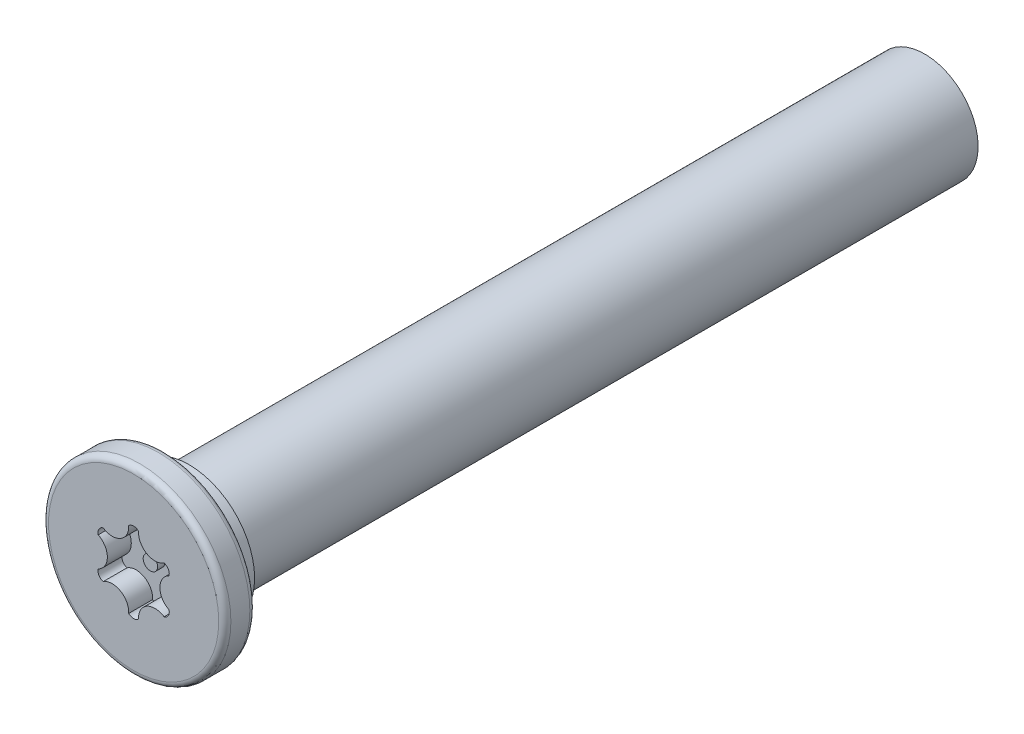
ISO-10303-21;
HEADER;
FILE_DESCRIPTION(('STEP AP214'),'2;1');
FILE_NAME('part.step','',(''),(''),'','','');
FILE_SCHEMA(('AUTOMOTIVE_DESIGN { 1 0 10303 214 1 1 1 1 }'));
ENDSEC;
DATA;
#1=APPLICATION_CONTEXT('core data for automotive mechanical design processes');
#2=APPLICATION_PROTOCOL_DEFINITION('international standard','automotive_design',2000,#1);
#3=PRODUCT_CONTEXT('',#1,'mechanical');
#4=PRODUCT('Part','Part','',(#3));
#5=PRODUCT_RELATED_PRODUCT_CATEGORY('part','',(#4));
#6=PRODUCT_DEFINITION_FORMATION('','',#4);
#7=PRODUCT_DEFINITION_CONTEXT('part definition',#1,'design');
#8=PRODUCT_DEFINITION('design','',#6,#7);
#9=PRODUCT_DEFINITION_SHAPE('','',#8);
#10=(LENGTH_UNIT() NAMED_UNIT(*) SI_UNIT(.MILLI.,.METRE.));
#11=(NAMED_UNIT(*) PLANE_ANGLE_UNIT() SI_UNIT($,.RADIAN.));
#12=(NAMED_UNIT(*) SI_UNIT($,.STERADIAN.) SOLID_ANGLE_UNIT());
#13=UNCERTAINTY_MEASURE_WITH_UNIT(LENGTH_MEASURE(1.E-05),#10,'distance_accuracy_value','');
#14=(GEOMETRIC_REPRESENTATION_CONTEXT(3) GLOBAL_UNCERTAINTY_ASSIGNED_CONTEXT((#13)) GLOBAL_UNIT_ASSIGNED_CONTEXT((#10,
#11,#12)) REPRESENTATION_CONTEXT('',''));
#15=CARTESIAN_POINT('',(0.,0.,0.));
#16=DIRECTION('',(0.,0.,1.));
#17=DIRECTION('',(1.,0.,0.));
#18=AXIS2_PLACEMENT_3D('',#15,#16,#17);
#19=CARTESIAN_POINT('',(0.,0.,0.));
#20=DIRECTION('',(0.,0.,1.));
#21=DIRECTION('',(1.,0.,0.));
#22=AXIS2_PLACEMENT_3D('',#19,#20,#21);
#23=PLANE('',#22);
#24=CARTESIAN_POINT('',(0.,0.,0.));
#25=DIRECTION('',(0.,0.,1.));
#26=DIRECTION('',(1.,0.,0.));
#27=AXIS2_PLACEMENT_3D('',#24,#25,#26);
#28=CIRCLE('',#27,3.55599999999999);
#29=CARTESIAN_POINT('',(3.55599999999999,0.,0.));
#30=VERTEX_POINT('',#29);
#31=EDGE_CURVE('E54',#30,#30,#28,.T.);
#32=ORIENTED_EDGE('',*,*,#31,.T.);
#33=EDGE_LOOP('',(#32));
#34=FACE_BOUND('',#33,.T.);
#35=CARTESIAN_POINT('',(0.893828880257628,1.54815703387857,0.));
#36=DIRECTION('',(0.,0.,1.));
#37=DIRECTION('',(1.,0.,0.));
#38=AXIS2_PLACEMENT_3D('',#35,#36,#37);
#39=CIRCLE('',#38,0.69);
#40=CARTESIAN_POINT('',(0.205060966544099,1.58937306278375,0.));
#41=VERTEX_POINT('',#40);
#42=CARTESIAN_POINT('',(1.27390696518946,0.972274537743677,0.));
#43=VERTEX_POINT('',#42);
#44=EDGE_CURVE('E181',#41,#43,#39,.T.);
#45=ORIENTED_EDGE('',*,*,#44,.T.);
#46=CARTESIAN_POINT('',(1.19884944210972,0.692156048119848,0.));
#47=DIRECTION('',(0.,0.,1.));
#48=DIRECTION('',(1.,0.,0.));
#49=AXIS2_PLACEMENT_3D('',#46,#47,#48);
#50=CIRCLE('',#49,0.29);
#51=CARTESIAN_POINT('',(1.47896793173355,0.617098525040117,0.));
#52=VERTEX_POINT('',#51);
#53=EDGE_CURVE('E61',#43,#52,#50,.F.);
#54=ORIENTED_EDGE('',*,*,#53,.T.);
#55=CARTESIAN_POINT('',(1.78765776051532,0.,0.));
#56=DIRECTION('',(0.,0.,1.));
#57=DIRECTION('',(1.,0.,0.));
#58=AXIS2_PLACEMENT_3D('',#55,#56,#57);
#59=CIRCLE('',#58,0.69);
#60=CARTESIAN_POINT('',(1.47896793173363,-0.617098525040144,0.));
#61=VERTEX_POINT('',#60);
#62=EDGE_CURVE('E111',#52,#61,#59,.T.);
#63=ORIENTED_EDGE('',*,*,#62,.T.);
#64=CARTESIAN_POINT('',(1.1988494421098,-0.692156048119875,0.));
#65=DIRECTION('',(0.,0.,1.));
#66=DIRECTION('',(1.,0.,0.));
#67=AXIS2_PLACEMENT_3D('',#64,#65,#66);
#68=CIRCLE('',#67,0.29);
#69=CARTESIAN_POINT('',(1.27390696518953,-0.972274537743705,0.));
#70=VERTEX_POINT('',#69);
#71=EDGE_CURVE('E216',#61,#70,#68,.F.);
#72=ORIENTED_EDGE('',*,*,#71,.T.);
#73=CARTESIAN_POINT('',(0.893828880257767,-1.54815703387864,0.));
#74=DIRECTION('',(0.,0.,1.));
#75=DIRECTION('',(1.,0.,0.));
#76=AXIS2_PLACEMENT_3D('',#73,#74,#75);
#77=CIRCLE('',#76,0.69);
#78=CARTESIAN_POINT('',(0.205060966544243,-1.5893730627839,0.));
#79=VERTEX_POINT('',#78);
#80=EDGE_CURVE('E160',#70,#79,#77,.T.);
#81=ORIENTED_EDGE('',*,*,#80,.T.);
#82=CARTESIAN_POINT('',(1.43067375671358E-13,-1.3843120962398,0.));
#83=DIRECTION('',(0.,0.,1.));
#84=DIRECTION('',(1.,0.,0.));
#85=AXIS2_PLACEMENT_3D('',#82,#83,#84);
#86=CIRCLE('',#85,0.29);
#87=CARTESIAN_POINT('',(-0.205060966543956,-1.5893730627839,0.));
#88=VERTEX_POINT('',#87);
#89=EDGE_CURVE('E210',#79,#88,#86,.F.);
#90=ORIENTED_EDGE('',*,*,#89,.T.);
#91=CARTESIAN_POINT('',(-0.893828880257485,-1.54815703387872,0.));
#92=DIRECTION('',(0.,0.,1.));
#93=DIRECTION('',(1.,0.,0.));
#94=AXIS2_PLACEMENT_3D('',#91,#92,#93);
#95=CIRCLE('',#94,0.69);
#96=CARTESIAN_POINT('',(-1.27390696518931,-0.97227453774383,0.));
#97=VERTEX_POINT('',#96);
#98=EDGE_CURVE('E206',#88,#97,#95,.T.);
#99=ORIENTED_EDGE('',*,*,#98,.T.);
#100=CARTESIAN_POINT('',(-1.19884944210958,-0.69215604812,0.));
#101=DIRECTION('',(0.,0.,1.));
#102=DIRECTION('',(1.,0.,0.));
#103=AXIS2_PLACEMENT_3D('',#100,#101,#102);
#104=CIRCLE('',#103,0.29);
#105=CARTESIAN_POINT('',(-1.47896793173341,-0.617098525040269,0.));
#106=VERTEX_POINT('',#105);
#107=EDGE_CURVE('E202',#97,#106,#104,.F.);
#108=ORIENTED_EDGE('',*,*,#107,.T.);
#109=CARTESIAN_POINT('',(-1.78765776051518,-1.56674837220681E-13,0.));
#110=DIRECTION('',(0.,0.,1.));
#111=DIRECTION('',(1.,0.,0.));
#112=AXIS2_PLACEMENT_3D('',#109,#110,#111);
#113=CIRCLE('',#112,0.69);
#114=CARTESIAN_POINT('',(-1.47896793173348,0.617098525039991,0.));
#115=VERTEX_POINT('',#114);
#116=EDGE_CURVE('E198',#106,#115,#113,.T.);
#117=ORIENTED_EDGE('',*,*,#116,.T.);
#118=CARTESIAN_POINT('',(-1.19884944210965,0.692156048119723,0.));
#119=DIRECTION('',(0.,0.,1.));
#120=DIRECTION('',(1.,0.,0.));
#121=AXIS2_PLACEMENT_3D('',#118,#119,#120);
#122=CIRCLE('',#121,0.29);
#123=CARTESIAN_POINT('',(-1.27390696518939,0.972274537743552,0.));
#124=VERTEX_POINT('',#123);
#125=EDGE_CURVE('E194',#115,#124,#122,.F.);
#126=ORIENTED_EDGE('',*,*,#125,.T.);
#127=CARTESIAN_POINT('',(-0.893828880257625,1.54815703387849,0.));
#128=DIRECTION('',(0.,0.,1.));
#129=DIRECTION('',(1.,0.,0.));
#130=AXIS2_PLACEMENT_3D('',#127,#128,#129);
#131=CIRCLE('',#130,0.690000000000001);
#132=CARTESIAN_POINT('',(-0.205060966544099,1.58937306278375,0.));
#133=VERTEX_POINT('',#132);
#134=EDGE_CURVE('E190',#124,#133,#131,.T.);
#135=ORIENTED_EDGE('',*,*,#134,.T.);
#136=CARTESIAN_POINT('',(0.,1.38431209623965,0.));
#137=DIRECTION('',(0.,0.,1.));
#138=DIRECTION('',(1.,0.,0.));
#139=AXIS2_PLACEMENT_3D('',#136,#137,#138);
#140=CIRCLE('',#139,0.29);
#141=EDGE_CURVE('E186',#133,#41,#140,.F.);
#142=ORIENTED_EDGE('',*,*,#141,.T.);
#143=EDGE_LOOP('',(#45,#54,#63,#72,#81,#90,#99,#108,#117,#126,#135,#142));
#144=FACE_BOUND('',#143,.T.);
#145=ADVANCED_FACE('F45',(#34,#144),#23,.T.);
#146=CARTESIAN_POINT('',(0.,0.,-1.3));
#147=DIRECTION('',(0.,0.,1.));
#148=DIRECTION('',(1.,0.,0.));
#149=AXIS2_PLACEMENT_3D('',#146,#147,#148);
#150=PLANE('',#149);
#151=CARTESIAN_POINT('',(0.,0.,-1.3));
#152=DIRECTION('',(0.,0.,1.));
#153=DIRECTION('',(1.,0.,0.));
#154=AXIS2_PLACEMENT_3D('',#151,#152,#153);
#155=CIRCLE('',#154,2.738000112);
#156=CARTESIAN_POINT('',(2.738000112,0.,-1.3));
#157=VERTEX_POINT('',#156);
#158=EDGE_CURVE('E11',#157,#157,#155,.F.);
#159=ORIENTED_EDGE('',*,*,#158,.F.);
#160=EDGE_LOOP('',(#159));
#161=FACE_BOUND('',#160,.T.);
#162=CARTESIAN_POINT('',(0.,0.,-1.3));
#163=DIRECTION('',(0.,0.,1.));
#164=DIRECTION('',(1.,0.,0.));
#165=AXIS2_PLACEMENT_3D('',#162,#163,#164);
#166=CIRCLE('',#165,3.55599999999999);
#167=CARTESIAN_POINT('',(3.55599999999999,0.,-1.3));
#168=VERTEX_POINT('',#167);
#169=EDGE_CURVE('E260',#168,#168,#166,.F.);
#170=ORIENTED_EDGE('',*,*,#169,.T.);
#171=EDGE_LOOP('',(#170));
#172=FACE_BOUND('',#171,.T.);
#173=ADVANCED_FACE('F283',(#161,#172),#150,.F.);
#174=CARTESIAN_POINT('',(0.,0.,-1.3));
#175=DIRECTION('',(0.,0.,1.));
#176=DIRECTION('',(1.,0.,0.));
#177=AXIS2_PLACEMENT_3D('',#174,#175,#176);
#178=CYLINDRICAL_SURFACE('',#177,3.80999999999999);
#179=CARTESIAN_POINT('',(0.,0.,-1.046));
#180=DIRECTION('',(0.,0.,1.));
#181=DIRECTION('',(1.,0.,0.));
#182=AXIS2_PLACEMENT_3D('',#179,#180,#181);
#183=CIRCLE('',#182,3.80999999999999);
#184=CARTESIAN_POINT('',(3.80999999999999,0.,-1.046));
#185=VERTEX_POINT('',#184);
#186=EDGE_CURVE('E256',#185,#185,#183,.T.);
#187=ORIENTED_EDGE('',*,*,#186,.T.);
#188=EDGE_LOOP('',(#187));
#189=FACE_BOUND('',#188,.T.);
#190=CARTESIAN_POINT('',(0.,0.,-0.254));
#191=DIRECTION('',(0.,0.,1.));
#192=DIRECTION('',(1.,0.,0.));
#193=AXIS2_PLACEMENT_3D('',#190,#191,#192);
#194=CIRCLE('',#193,3.80999999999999);
#195=CARTESIAN_POINT('',(3.80999999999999,0.,-0.254));
#196=VERTEX_POINT('',#195);
#197=EDGE_CURVE('E225',#196,#196,#194,.F.);
#198=ORIENTED_EDGE('',*,*,#197,.T.);
#199=EDGE_LOOP('',(#198));
#200=FACE_BOUND('',#199,.T.);
#201=ADVANCED_FACE('F289',(#189,#200),#178,.T.);
#202=CARTESIAN_POINT('',(1.19884944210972,0.692156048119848,-1.));
#203=DIRECTION('',(0.,0.,1.));
#204=DIRECTION('',(1.,0.,0.));
#205=AXIS2_PLACEMENT_3D('',#202,#203,#204);
#206=CYLINDRICAL_SURFACE('',#205,0.29);
#207=ORIENTED_EDGE('',*,*,#53,.F.);
#208=DIRECTION('',(0.,0.,1.));
#209=VECTOR('',#208,1.);
#210=CARTESIAN_POINT('',(1.27390696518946,0.972274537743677,-1.));
#211=LINE('',#210,#209);
#212=CARTESIAN_POINT('',(1.27390696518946,0.972274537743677,-1.));
#213=VERTEX_POINT('',#212);
#214=EDGE_CURVE('E178',#213,#43,#211,.T.);
#215=ORIENTED_EDGE('',*,*,#214,.F.);
#216=CARTESIAN_POINT('',(1.19884944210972,0.692156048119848,-1.));
#217=DIRECTION('',(0.,0.,1.));
#218=DIRECTION('',(1.,0.,0.));
#219=AXIS2_PLACEMENT_3D('',#216,#217,#218);
#220=CIRCLE('',#219,0.29);
#221=CARTESIAN_POINT('',(1.47896793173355,0.617098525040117,-1.));
#222=VERTEX_POINT('',#221);
#223=EDGE_CURVE('E221',#213,#222,#220,.F.);
#224=ORIENTED_EDGE('',*,*,#223,.T.);
#225=DIRECTION('',(0.,0.,1.));
#226=VECTOR('',#225,1.);
#227=CARTESIAN_POINT('',(1.47896793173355,0.617098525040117,-1.));
#228=LINE('',#227,#226);
#229=EDGE_CURVE('E222',#222,#52,#228,.T.);
#230=ORIENTED_EDGE('',*,*,#229,.T.);
#231=EDGE_LOOP('',(#207,#215,#224,#230));
#232=FACE_BOUND('',#231,.T.);
#233=ADVANCED_FACE('F294',(#232),#206,.F.);
#234=CARTESIAN_POINT('',(1.78765776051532,0.,-1.));
#235=DIRECTION('',(0.,0.,1.));
#236=DIRECTION('',(1.,0.,0.));
#237=AXIS2_PLACEMENT_3D('',#234,#235,#236);
#238=CYLINDRICAL_SURFACE('',#237,0.69);
#239=ORIENTED_EDGE('',*,*,#62,.F.);
#240=ORIENTED_EDGE('',*,*,#229,.F.);
#241=CARTESIAN_POINT('',(1.78765776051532,0.,-1.));
#242=DIRECTION('',(0.,0.,1.));
#243=DIRECTION('',(1.,0.,0.));
#244=AXIS2_PLACEMENT_3D('',#241,#242,#243);
#245=CIRCLE('',#244,0.69);
#246=CARTESIAN_POINT('',(1.47896793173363,-0.617098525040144,-1.));
#247=VERTEX_POINT('',#246);
#248=EDGE_CURVE('E70',#222,#247,#245,.T.);
#249=ORIENTED_EDGE('',*,*,#248,.T.);
#250=DIRECTION('',(0.,0.,1.));
#251=VECTOR('',#250,1.);
#252=CARTESIAN_POINT('',(1.47896793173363,-0.617098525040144,-1.));
#253=LINE('',#252,#251);
#254=EDGE_CURVE('E151',#247,#61,#253,.T.);
#255=ORIENTED_EDGE('',*,*,#254,.T.);
#256=EDGE_LOOP('',(#239,#240,#249,#255));
#257=FACE_BOUND('',#256,.T.);
#258=ADVANCED_FACE('F301',(#257),#238,.T.);
#259=CARTESIAN_POINT('',(1.1988494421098,-0.692156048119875,-1.));
#260=DIRECTION('',(0.,0.,1.));
#261=DIRECTION('',(1.,0.,0.));
#262=AXIS2_PLACEMENT_3D('',#259,#260,#261);
#263=CYLINDRICAL_SURFACE('',#262,0.29);
#264=ORIENTED_EDGE('',*,*,#71,.F.);
#265=ORIENTED_EDGE('',*,*,#254,.F.);
#266=CARTESIAN_POINT('',(1.1988494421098,-0.692156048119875,-1.));
#267=DIRECTION('',(0.,0.,1.));
#268=DIRECTION('',(1.,0.,0.));
#269=AXIS2_PLACEMENT_3D('',#266,#267,#268);
#270=CIRCLE('',#269,0.29);
#271=CARTESIAN_POINT('',(1.27390696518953,-0.972274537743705,-1.));
#272=VERTEX_POINT('',#271);
#273=EDGE_CURVE('E145',#247,#272,#270,.F.);
#274=ORIENTED_EDGE('',*,*,#273,.T.);
#275=DIRECTION('',(0.,0.,1.));
#276=VECTOR('',#275,1.);
#277=CARTESIAN_POINT('',(1.27390696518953,-0.972274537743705,-1.));
#278=LINE('',#277,#276);
#279=EDGE_CURVE('E149',#272,#70,#278,.T.);
#280=ORIENTED_EDGE('',*,*,#279,.T.);
#281=EDGE_LOOP('',(#264,#265,#274,#280));
#282=FACE_BOUND('',#281,.T.);
#283=ADVANCED_FACE('F148',(#282),#263,.F.);
#284=CARTESIAN_POINT('',(0.893828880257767,-1.54815703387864,-1.));
#285=DIRECTION('',(0.,0.,1.));
#286=DIRECTION('',(1.,0.,0.));
#287=AXIS2_PLACEMENT_3D('',#284,#285,#286);
#288=CYLINDRICAL_SURFACE('',#287,0.69);
#289=ORIENTED_EDGE('',*,*,#80,.F.);
#290=ORIENTED_EDGE('',*,*,#279,.F.);
#291=CARTESIAN_POINT('',(0.893828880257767,-1.54815703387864,-1.));
#292=DIRECTION('',(0.,0.,1.));
#293=DIRECTION('',(1.,0.,0.));
#294=AXIS2_PLACEMENT_3D('',#291,#292,#293);
#295=CIRCLE('',#294,0.69);
#296=CARTESIAN_POINT('',(0.205060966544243,-1.5893730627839,-1.));
#297=VERTEX_POINT('',#296);
#298=EDGE_CURVE('E154',#272,#297,#295,.T.);
#299=ORIENTED_EDGE('',*,*,#298,.T.);
#300=DIRECTION('',(0.,0.,1.));
#301=VECTOR('',#300,1.);
#302=CARTESIAN_POINT('',(0.205060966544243,-1.5893730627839,-1.));
#303=LINE('',#302,#301);
#304=EDGE_CURVE('E163',#297,#79,#303,.T.);
#305=ORIENTED_EDGE('',*,*,#304,.T.);
#306=EDGE_LOOP('',(#289,#290,#299,#305));
#307=FACE_BOUND('',#306,.T.);
#308=ADVANCED_FACE('F157',(#307),#288,.T.);
#309=CARTESIAN_POINT('',(1.43067375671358E-13,-1.3843120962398,-1.));
#310=DIRECTION('',(0.,0.,1.));
#311=DIRECTION('',(1.,0.,0.));
#312=AXIS2_PLACEMENT_3D('',#309,#310,#311);
#313=CYLINDRICAL_SURFACE('',#312,0.29);
#314=ORIENTED_EDGE('',*,*,#89,.F.);
#315=ORIENTED_EDGE('',*,*,#304,.F.);
#316=CARTESIAN_POINT('',(1.43067375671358E-13,-1.3843120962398,-1.));
#317=DIRECTION('',(0.,0.,1.));
#318=DIRECTION('',(1.,0.,0.));
#319=AXIS2_PLACEMENT_3D('',#316,#317,#318);
#320=CIRCLE('',#319,0.29);
#321=CARTESIAN_POINT('',(-0.205060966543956,-1.5893730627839,-1.));
#322=VERTEX_POINT('',#321);
#323=EDGE_CURVE('E168',#297,#322,#320,.F.);
#324=ORIENTED_EDGE('',*,*,#323,.T.);
#325=DIRECTION('',(0.,0.,1.));
#326=VECTOR('',#325,1.);
#327=CARTESIAN_POINT('',(-0.205060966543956,-1.5893730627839,-1.));
#328=LINE('',#327,#326);
#329=EDGE_CURVE('E230',#322,#88,#328,.T.);
#330=ORIENTED_EDGE('',*,*,#329,.T.);
#331=EDGE_LOOP('',(#314,#315,#324,#330));
#332=FACE_BOUND('',#331,.T.);
#333=ADVANCED_FACE('F318',(#332),#313,.F.);
#334=CARTESIAN_POINT('',(-0.893828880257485,-1.54815703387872,-1.));
#335=DIRECTION('',(0.,0.,1.));
#336=DIRECTION('',(1.,0.,0.));
#337=AXIS2_PLACEMENT_3D('',#334,#335,#336);
#338=CYLINDRICAL_SURFACE('',#337,0.69);
#339=ORIENTED_EDGE('',*,*,#98,.F.);
#340=ORIENTED_EDGE('',*,*,#329,.F.);
#341=CARTESIAN_POINT('',(-0.893828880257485,-1.54815703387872,-1.));
#342=DIRECTION('',(0.,0.,1.));
#343=DIRECTION('',(1.,0.,0.));
#344=AXIS2_PLACEMENT_3D('',#341,#342,#343);
#345=CIRCLE('',#344,0.69);
#346=CARTESIAN_POINT('',(-1.27390696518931,-0.97227453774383,-1.));
#347=VERTEX_POINT('',#346);
#348=EDGE_CURVE('E172',#322,#347,#345,.T.);
#349=ORIENTED_EDGE('',*,*,#348,.T.);
#350=DIRECTION('',(0.,0.,1.));
#351=VECTOR('',#350,1.);
#352=CARTESIAN_POINT('',(-1.27390696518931,-0.97227453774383,-1.));
#353=LINE('',#352,#351);
#354=EDGE_CURVE('E233',#347,#97,#353,.T.);
#355=ORIENTED_EDGE('',*,*,#354,.T.);
#356=EDGE_LOOP('',(#339,#340,#349,#355));
#357=FACE_BOUND('',#356,.T.);
#358=ADVANCED_FACE('F321',(#357),#338,.T.);
#359=CARTESIAN_POINT('',(-1.19884944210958,-0.69215604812,-1.));
#360=DIRECTION('',(0.,0.,1.));
#361=DIRECTION('',(1.,0.,0.));
#362=AXIS2_PLACEMENT_3D('',#359,#360,#361);
#363=CYLINDRICAL_SURFACE('',#362,0.29);
#364=ORIENTED_EDGE('',*,*,#107,.F.);
#365=ORIENTED_EDGE('',*,*,#354,.F.);
#366=CARTESIAN_POINT('',(-1.19884944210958,-0.69215604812,-1.));
#367=DIRECTION('',(0.,0.,1.));
#368=DIRECTION('',(1.,0.,0.));
#369=AXIS2_PLACEMENT_3D('',#366,#367,#368);
#370=CIRCLE('',#369,0.29);
#371=CARTESIAN_POINT('',(-1.47896793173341,-0.617098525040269,-1.));
#372=VERTEX_POINT('',#371);
#373=EDGE_CURVE('E374',#347,#372,#370,.F.);
#374=ORIENTED_EDGE('',*,*,#373,.T.);
#375=DIRECTION('',(0.,0.,1.));
#376=VECTOR('',#375,1.);
#377=CARTESIAN_POINT('',(-1.47896793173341,-0.617098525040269,-1.));
#378=LINE('',#377,#376);
#379=EDGE_CURVE('E236',#372,#106,#378,.T.);
#380=ORIENTED_EDGE('',*,*,#379,.T.);
#381=EDGE_LOOP('',(#364,#365,#374,#380));
#382=FACE_BOUND('',#381,.T.);
#383=ADVANCED_FACE('F325',(#382),#363,.F.);
#384=CARTESIAN_POINT('',(-1.78765776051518,-1.56674837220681E-13,-1.));
#385=DIRECTION('',(0.,0.,1.));
#386=DIRECTION('',(1.,0.,0.));
#387=AXIS2_PLACEMENT_3D('',#384,#385,#386);
#388=CYLINDRICAL_SURFACE('',#387,0.69);
#389=ORIENTED_EDGE('',*,*,#116,.F.);
#390=ORIENTED_EDGE('',*,*,#379,.F.);
#391=CARTESIAN_POINT('',(-1.78765776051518,-1.56674837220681E-13,-1.));
#392=DIRECTION('',(0.,0.,1.));
#393=DIRECTION('',(1.,0.,0.));
#394=AXIS2_PLACEMENT_3D('',#391,#392,#393);
#395=CIRCLE('',#394,0.69);
#396=CARTESIAN_POINT('',(-1.47896793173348,0.617098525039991,-1.));
#397=VERTEX_POINT('',#396);
#398=EDGE_CURVE('E371',#372,#397,#395,.T.);
#399=ORIENTED_EDGE('',*,*,#398,.T.);
#400=DIRECTION('',(0.,0.,1.));
#401=VECTOR('',#400,1.);
#402=CARTESIAN_POINT('',(-1.47896793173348,0.617098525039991,-1.));
#403=LINE('',#402,#401);
#404=EDGE_CURVE('E239',#397,#115,#403,.T.);
#405=ORIENTED_EDGE('',*,*,#404,.T.);
#406=EDGE_LOOP('',(#389,#390,#399,#405));
#407=FACE_BOUND('',#406,.T.);
#408=ADVANCED_FACE('F329',(#407),#388,.T.);
#409=CARTESIAN_POINT('',(-1.19884944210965,0.692156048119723,-1.));
#410=DIRECTION('',(0.,0.,1.));
#411=DIRECTION('',(1.,0.,0.));
#412=AXIS2_PLACEMENT_3D('',#409,#410,#411);
#413=CYLINDRICAL_SURFACE('',#412,0.29);
#414=ORIENTED_EDGE('',*,*,#125,.F.);
#415=ORIENTED_EDGE('',*,*,#404,.F.);
#416=CARTESIAN_POINT('',(-1.19884944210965,0.692156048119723,-1.));
#417=DIRECTION('',(0.,0.,1.));
#418=DIRECTION('',(1.,0.,0.));
#419=AXIS2_PLACEMENT_3D('',#416,#417,#418);
#420=CIRCLE('',#419,0.29);
#421=CARTESIAN_POINT('',(-1.27390696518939,0.972274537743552,-1.));
#422=VERTEX_POINT('',#421);
#423=EDGE_CURVE('E364',#397,#422,#420,.F.);
#424=ORIENTED_EDGE('',*,*,#423,.T.);
#425=DIRECTION('',(0.,0.,1.));
#426=VECTOR('',#425,1.);
#427=CARTESIAN_POINT('',(-1.27390696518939,0.972274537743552,-1.));
#428=LINE('',#427,#426);
#429=EDGE_CURVE('E242',#422,#124,#428,.T.);
#430=ORIENTED_EDGE('',*,*,#429,.T.);
#431=EDGE_LOOP('',(#414,#415,#424,#430));
#432=FACE_BOUND('',#431,.T.);
#433=ADVANCED_FACE('F333',(#432),#413,.F.);
#434=CARTESIAN_POINT('',(-0.893828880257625,1.54815703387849,-1.));
#435=DIRECTION('',(0.,0.,1.));
#436=DIRECTION('',(1.,0.,0.));
#437=AXIS2_PLACEMENT_3D('',#434,#435,#436);
#438=CYLINDRICAL_SURFACE('',#437,0.690000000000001);
#439=ORIENTED_EDGE('',*,*,#134,.F.);
#440=ORIENTED_EDGE('',*,*,#429,.F.);
#441=CARTESIAN_POINT('',(-0.893828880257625,1.54815703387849,-1.));
#442=DIRECTION('',(0.,0.,1.));
#443=DIRECTION('',(1.,0.,0.));
#444=AXIS2_PLACEMENT_3D('',#441,#442,#443);
#445=CIRCLE('',#444,0.690000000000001);
#446=CARTESIAN_POINT('',(-0.205060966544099,1.58937306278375,-1.));
#447=VERTEX_POINT('',#446);
#448=EDGE_CURVE('E360',#422,#447,#445,.T.);
#449=ORIENTED_EDGE('',*,*,#448,.T.);
#450=DIRECTION('',(0.,0.,1.));
#451=VECTOR('',#450,1.);
#452=CARTESIAN_POINT('',(-0.205060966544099,1.58937306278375,-1.));
#453=LINE('',#452,#451);
#454=EDGE_CURVE('E245',#447,#133,#453,.T.);
#455=ORIENTED_EDGE('',*,*,#454,.T.);
#456=EDGE_LOOP('',(#439,#440,#449,#455));
#457=FACE_BOUND('',#456,.T.);
#458=ADVANCED_FACE('F337',(#457),#438,.T.);
#459=CARTESIAN_POINT('',(0.,1.38431209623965,-1.));
#460=DIRECTION('',(0.,0.,1.));
#461=DIRECTION('',(1.,0.,0.));
#462=AXIS2_PLACEMENT_3D('',#459,#460,#461);
#463=CYLINDRICAL_SURFACE('',#462,0.29);
#464=ORIENTED_EDGE('',*,*,#141,.F.);
#465=ORIENTED_EDGE('',*,*,#454,.F.);
#466=CARTESIAN_POINT('',(0.,1.38431209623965,-1.));
#467=DIRECTION('',(0.,0.,1.));
#468=DIRECTION('',(1.,0.,0.));
#469=AXIS2_PLACEMENT_3D('',#466,#467,#468);
#470=CIRCLE('',#469,0.29);
#471=CARTESIAN_POINT('',(0.205060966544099,1.58937306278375,-1.));
#472=VERTEX_POINT('',#471);
#473=EDGE_CURVE('E357',#447,#472,#470,.F.);
#474=ORIENTED_EDGE('',*,*,#473,.T.);
#475=DIRECTION('',(0.,0.,1.));
#476=VECTOR('',#475,1.);
#477=CARTESIAN_POINT('',(0.205060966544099,1.58937306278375,-1.));
#478=LINE('',#477,#476);
#479=EDGE_CURVE('E248',#472,#41,#478,.T.);
#480=ORIENTED_EDGE('',*,*,#479,.T.);
#481=EDGE_LOOP('',(#464,#465,#474,#480));
#482=FACE_BOUND('',#481,.T.);
#483=ADVANCED_FACE('F341',(#482),#463,.F.);
#484=CARTESIAN_POINT('',(0.893828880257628,1.54815703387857,-1.));
#485=DIRECTION('',(0.,0.,1.));
#486=DIRECTION('',(1.,0.,0.));
#487=AXIS2_PLACEMENT_3D('',#484,#485,#486);
#488=CYLINDRICAL_SURFACE('',#487,0.69);
#489=ORIENTED_EDGE('',*,*,#44,.F.);
#490=ORIENTED_EDGE('',*,*,#479,.F.);
#491=CARTESIAN_POINT('',(0.893828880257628,1.54815703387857,-1.));
#492=DIRECTION('',(0.,0.,1.));
#493=DIRECTION('',(1.,0.,0.));
#494=AXIS2_PLACEMENT_3D('',#491,#492,#493);
#495=CIRCLE('',#494,0.69);
#496=EDGE_CURVE('E118',#472,#213,#495,.T.);
#497=ORIENTED_EDGE('',*,*,#496,.T.);
#498=ORIENTED_EDGE('',*,*,#214,.T.);
#499=EDGE_LOOP('',(#489,#490,#497,#498));
#500=FACE_BOUND('',#499,.T.);
#501=ADVANCED_FACE('F344',(#500),#488,.T.);
#502=CARTESIAN_POINT('',(0.,0.,-1.));
#503=DIRECTION('',(0.,0.,1.));
#504=DIRECTION('',(1.,0.,0.));
#505=AXIS2_PLACEMENT_3D('',#502,#503,#504);
#506=PLANE('',#505);
#507=CARTESIAN_POINT('',(0.,0.,-1.));
#508=DIRECTION('',(0.,0.,1.));
#509=DIRECTION('',(1.,0.,0.));
#510=AXIS2_PLACEMENT_3D('',#507,#508,#509);
#511=CIRCLE('',#510,0.3);
#512=CARTESIAN_POINT('',(0.3,0.,-1.));
#513=VERTEX_POINT('',#512);
#514=EDGE_CURVE('E396',#513,#513,#511,.T.);
#515=ORIENTED_EDGE('',*,*,#514,.F.);
#516=EDGE_LOOP('',(#515));
#517=FACE_BOUND('',#516,.T.);
#518=ORIENTED_EDGE('',*,*,#223,.F.);
#519=ORIENTED_EDGE('',*,*,#496,.F.);
#520=ORIENTED_EDGE('',*,*,#473,.F.);
#521=ORIENTED_EDGE('',*,*,#448,.F.);
#522=ORIENTED_EDGE('',*,*,#423,.F.);
#523=ORIENTED_EDGE('',*,*,#398,.F.);
#524=ORIENTED_EDGE('',*,*,#373,.F.);
#525=ORIENTED_EDGE('',*,*,#348,.F.);
#526=ORIENTED_EDGE('',*,*,#323,.F.);
#527=ORIENTED_EDGE('',*,*,#298,.F.);
#528=ORIENTED_EDGE('',*,*,#273,.F.);
#529=ORIENTED_EDGE('',*,*,#248,.F.);
#530=EDGE_LOOP('',(#518,#519,#520,#521,#522,#523,#524,#525,#526,#527,#528,#529));
#531=FACE_BOUND('',#530,.T.);
#532=ADVANCED_FACE('F166',(#517,#531),#506,.T.);
#533=CARTESIAN_POINT('',(0.,0.,-1.046));
#534=DIRECTION('',(0.,0.,1.));
#535=DIRECTION('',(1.,0.,0.));
#536=AXIS2_PLACEMENT_3D('',#533,#534,#535);
#537=TOROIDAL_SURFACE('',#536,3.55599999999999,0.254);
#538=ORIENTED_EDGE('',*,*,#169,.F.);
#539=EDGE_LOOP('',(#538));
#540=FACE_BOUND('',#539,.T.);
#541=ORIENTED_EDGE('',*,*,#186,.F.);
#542=EDGE_LOOP('',(#541));
#543=FACE_BOUND('',#542,.T.);
#544=ADVANCED_FACE('F271',(#540,#543),#537,.T.);
#545=CARTESIAN_POINT('',(0.,0.,-0.254));
#546=DIRECTION('',(0.,0.,1.));
#547=DIRECTION('',(1.,0.,0.));
#548=AXIS2_PLACEMENT_3D('',#545,#546,#547);
#549=TOROIDAL_SURFACE('',#548,3.55599999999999,0.254);
#550=ORIENTED_EDGE('',*,*,#197,.F.);
#551=EDGE_LOOP('',(#550));
#552=FACE_BOUND('',#551,.T.);
#553=ORIENTED_EDGE('',*,*,#31,.F.);
#554=EDGE_LOOP('',(#553));
#555=FACE_BOUND('',#554,.T.);
#556=ADVANCED_FACE('F47',(#552,#555),#549,.T.);
#557=CARTESIAN_POINT('',(0.,0.,-2.316));
#558=DIRECTION('',(0.,0.,-1.));
#559=DIRECTION('',(-1.,0.,0.));
#560=AXIS2_PLACEMENT_3D('',#557,#558,#559);
#561=PLANE('',#560);
#562=CARTESIAN_POINT('',(0.,0.,-2.316));
#563=DIRECTION('',(0.,0.,-1.));
#564=DIRECTION('',(-1.,0.,0.));
#565=AXIS2_PLACEMENT_3D('',#562,#563,#564);
#566=CIRCLE('',#565,2.738000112);
#567=CARTESIAN_POINT('',(-2.738000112,0.,-2.316));
#568=VERTEX_POINT('',#567);
#569=EDGE_CURVE('E182',#568,#568,#566,.T.);
#570=ORIENTED_EDGE('',*,*,#569,.T.);
#571=EDGE_LOOP('',(#570));
#572=FACE_BOUND('',#571,.T.);
#573=CARTESIAN_POINT('',(0.,0.,-2.316));
#574=DIRECTION('',(0.,0.,-1.));
#575=DIRECTION('',(-1.,0.,0.));
#576=AXIS2_PLACEMENT_3D('',#573,#574,#575);
#577=CIRCLE('',#576,2.230000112);
#578=CARTESIAN_POINT('',(-2.230000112,0.,-2.316));
#579=VERTEX_POINT('',#578);
#580=EDGE_CURVE('E400',#579,#579,#577,.T.);
#581=ORIENTED_EDGE('',*,*,#580,.F.);
#582=EDGE_LOOP('',(#581));
#583=FACE_BOUND('',#582,.T.);
#584=ADVANCED_FACE('F270',(#572,#583),#561,.T.);
#585=CARTESIAN_POINT('',(0.,0.,-2.316));
#586=DIRECTION('',(0.,0.,1.));
#587=DIRECTION('',(1.,0.,0.));
#588=AXIS2_PLACEMENT_3D('',#585,#586,#587);
#589=CYLINDRICAL_SURFACE('',#588,2.738000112);
#590=ORIENTED_EDGE('',*,*,#569,.F.);
#591=EDGE_LOOP('',(#590));
#592=FACE_BOUND('',#591,.T.);
#593=ORIENTED_EDGE('',*,*,#158,.T.);
#594=EDGE_LOOP('',(#593));
#595=FACE_BOUND('',#594,.T.);
#596=ADVANCED_FACE('F277',(#592,#595),#589,.T.);
#597=CARTESIAN_POINT('',(0.,0.,-0.7));
#598=DIRECTION('',(0.,0.,-1.));
#599=DIRECTION('',(-1.,0.,0.));
#600=AXIS2_PLACEMENT_3D('',#597,#598,#599);
#601=CYLINDRICAL_SURFACE('',#600,0.3);
#602=CARTESIAN_POINT('',(0.,0.,-0.7));
#603=DIRECTION('',(0.,0.,1.));
#604=DIRECTION('',(1.,0.,0.));
#605=AXIS2_PLACEMENT_3D('',#602,#603,#604);
#606=CIRCLE('',#605,0.3);
#607=CARTESIAN_POINT('',(0.3,0.,-0.7));
#608=VERTEX_POINT('',#607);
#609=EDGE_CURVE('E395',#608,#608,#606,.T.);
#610=ORIENTED_EDGE('',*,*,#609,.F.);
#611=EDGE_LOOP('',(#610));
#612=FACE_BOUND('',#611,.T.);
#613=ORIENTED_EDGE('',*,*,#514,.T.);
#614=EDGE_LOOP('',(#613));
#615=FACE_BOUND('',#614,.T.);
#616=ADVANCED_FACE('F424',(#612,#615),#601,.T.);
#617=CARTESIAN_POINT('',(0.,0.,-0.7));
#618=DIRECTION('',(0.,0.,1.));
#619=DIRECTION('',(1.,0.,0.));
#620=AXIS2_PLACEMENT_3D('',#617,#618,#619);
#621=PLANE('',#620);
#622=ORIENTED_EDGE('',*,*,#609,.T.);
#623=EDGE_LOOP('',(#622));
#624=FACE_BOUND('',#623,.T.);
#625=ADVANCED_FACE('F416',(#624),#621,.T.);
#626=CARTESIAN_POINT('',(0.,0.,-33.05));
#627=DIRECTION('',(0.,0.,1.));
#628=DIRECTION('',(1.,0.,0.));
#629=AXIS2_PLACEMENT_3D('',#626,#627,#628);
#630=CYLINDRICAL_SURFACE('',#629,2.230000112);
#631=ORIENTED_EDGE('',*,*,#580,.T.);
#632=EDGE_LOOP('',(#631));
#633=FACE_BOUND('',#632,.T.);
#634=CARTESIAN_POINT('',(0.,0.,-33.05));
#635=DIRECTION('',(0.,0.,-1.));
#636=DIRECTION('',(-1.,0.,0.));
#637=AXIS2_PLACEMENT_3D('',#634,#635,#636);
#638=CIRCLE('',#637,2.230000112);
#639=CARTESIAN_POINT('',(-2.230000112,0.,-33.05));
#640=VERTEX_POINT('',#639);
#641=EDGE_CURVE('E407',#640,#640,#638,.T.);
#642=ORIENTED_EDGE('',*,*,#641,.F.);
#643=EDGE_LOOP('',(#642));
#644=FACE_BOUND('',#643,.T.);
#645=ADVANCED_FACE('F414',(#633,#644),#630,.T.);
#646=CARTESIAN_POINT('',(0.,0.,-33.05));
#647=DIRECTION('',(0.,0.,-1.));
#648=DIRECTION('',(-1.,0.,0.));
#649=AXIS2_PLACEMENT_3D('',#646,#647,#648);
#650=PLANE('',#649);
#651=ORIENTED_EDGE('',*,*,#641,.T.);
#652=EDGE_LOOP('',(#651));
#653=FACE_BOUND('',#652,.T.);
#654=ADVANCED_FACE('F412',(#653),#650,.T.);
#655=CLOSED_SHELL('',(#145,#173,#201,#233,#258,#283,#308,#333,#358,#383,#408,#433,#458,#483,
#501,#532,#544,#556,#584,#596,#616,#625,#645,#654));
#656=MANIFOLD_SOLID_BREP('B2',#655);
#657=ADVANCED_BREP_SHAPE_REPRESENTATION('',(#18,#656),#14);
#658=SHAPE_DEFINITION_REPRESENTATION(#9,#657);
ENDSEC;
END-ISO-10303-21;
